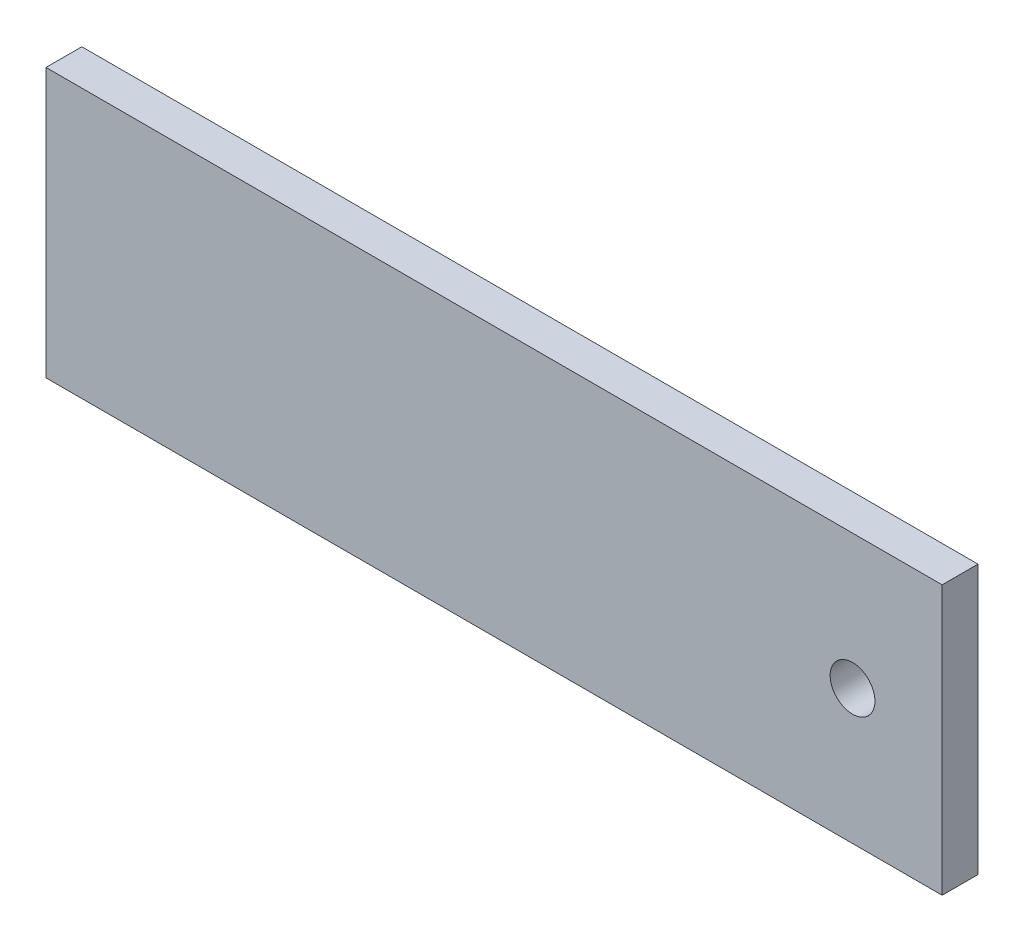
ISO-10303-21;
HEADER;
FILE_DESCRIPTION(('STEP AP214'),'2;1');
FILE_NAME('part.step','',(''),(''),'','','');
FILE_SCHEMA(('AUTOMOTIVE_DESIGN { 1 0 10303 214 1 1 1 1 }'));
ENDSEC;
DATA;
#1=APPLICATION_CONTEXT('core data for automotive mechanical design processes');
#2=APPLICATION_PROTOCOL_DEFINITION('international standard','automotive_design',2000,#1);
#3=PRODUCT_CONTEXT('',#1,'mechanical');
#4=PRODUCT('Part','Part','',(#3));
#5=PRODUCT_RELATED_PRODUCT_CATEGORY('part','',(#4));
#6=PRODUCT_DEFINITION_FORMATION('','',#4);
#7=PRODUCT_DEFINITION_CONTEXT('part definition',#1,'design');
#8=PRODUCT_DEFINITION('design','',#6,#7);
#9=PRODUCT_DEFINITION_SHAPE('','',#8);
#10=(LENGTH_UNIT() NAMED_UNIT(*) SI_UNIT(.MILLI.,.METRE.));
#11=(NAMED_UNIT(*) PLANE_ANGLE_UNIT() SI_UNIT($,.RADIAN.));
#12=(NAMED_UNIT(*) SI_UNIT($,.STERADIAN.) SOLID_ANGLE_UNIT());
#13=UNCERTAINTY_MEASURE_WITH_UNIT(LENGTH_MEASURE(1.E-05),#10,'distance_accuracy_value','');
#14=(GEOMETRIC_REPRESENTATION_CONTEXT(3) GLOBAL_UNCERTAINTY_ASSIGNED_CONTEXT((#13)) GLOBAL_UNIT_ASSIGNED_CONTEXT((#10,
#11,#12)) REPRESENTATION_CONTEXT('',''));
#15=CARTESIAN_POINT('',(0.,0.,0.));
#16=DIRECTION('',(0.,0.,1.));
#17=DIRECTION('',(1.,0.,0.));
#18=AXIS2_PLACEMENT_3D('',#15,#16,#17);
#19=CARTESIAN_POINT('',(100.,0.,2.));
#20=DIRECTION('',(-1.,0.,0.));
#21=DIRECTION('',(0.,0.,1.));
#22=AXIS2_PLACEMENT_3D('',#19,#20,#21);
#23=PLANE('',#22);
#24=DIRECTION('',(0.,1.,0.));
#25=VECTOR('',#24,1.);
#26=CARTESIAN_POINT('',(100.,0.,-2.));
#27=LINE('',#26,#25);
#28=CARTESIAN_POINT('',(100.,-30.,-2.));
#29=VERTEX_POINT('',#28);
#30=CARTESIAN_POINT('',(100.,0.,-2.));
#31=VERTEX_POINT('',#30);
#32=EDGE_CURVE('E81',#29,#31,#27,.T.);
#33=ORIENTED_EDGE('',*,*,#32,.T.);
#34=DIRECTION('',(0.,0.,-1.));
#35=VECTOR('',#34,1.);
#36=CARTESIAN_POINT('',(100.,0.,2.));
#37=LINE('',#36,#35);
#38=CARTESIAN_POINT('',(100.,0.,2.));
#39=VERTEX_POINT('',#38);
#40=EDGE_CURVE('E11',#39,#31,#37,.T.);
#41=ORIENTED_EDGE('',*,*,#40,.F.);
#42=DIRECTION('',(0.,1.,0.));
#43=VECTOR('',#42,1.);
#44=CARTESIAN_POINT('',(100.,0.,2.));
#45=LINE('',#44,#43);
#46=CARTESIAN_POINT('',(100.,-30.,2.));
#47=VERTEX_POINT('',#46);
#48=EDGE_CURVE('E110',#47,#39,#45,.T.);
#49=ORIENTED_EDGE('',*,*,#48,.F.);
#50=DIRECTION('',(0.,0.,-1.));
#51=VECTOR('',#50,1.);
#52=CARTESIAN_POINT('',(100.,-30.,2.));
#53=LINE('',#52,#51);
#54=EDGE_CURVE('E94',#47,#29,#53,.T.);
#55=ORIENTED_EDGE('',*,*,#54,.T.);
#56=EDGE_LOOP('',(#33,#41,#49,#55));
#57=FACE_BOUND('',#56,.T.);
#58=ADVANCED_FACE('F36',(#57),#23,.F.);
#59=CARTESIAN_POINT('',(0.,0.,2.));
#60=DIRECTION('',(0.,-1.,0.));
#61=DIRECTION('',(1.,0.,0.));
#62=AXIS2_PLACEMENT_3D('',#59,#60,#61);
#63=PLANE('',#62);
#64=DIRECTION('',(-1.,0.,0.));
#65=VECTOR('',#64,1.);
#66=CARTESIAN_POINT('',(0.,0.,-2.));
#67=LINE('',#66,#65);
#68=CARTESIAN_POINT('',(0.,0.,-2.));
#69=VERTEX_POINT('',#68);
#70=EDGE_CURVE('E77',#31,#69,#67,.T.);
#71=ORIENTED_EDGE('',*,*,#70,.T.);
#72=DIRECTION('',(0.,0.,-1.));
#73=VECTOR('',#72,1.);
#74=CARTESIAN_POINT('',(0.,0.,2.));
#75=LINE('',#74,#73);
#76=CARTESIAN_POINT('',(0.,0.,2.));
#77=VERTEX_POINT('',#76);
#78=EDGE_CURVE('E44',#77,#69,#75,.T.);
#79=ORIENTED_EDGE('',*,*,#78,.F.);
#80=DIRECTION('',(-1.,0.,0.));
#81=VECTOR('',#80,1.);
#82=CARTESIAN_POINT('',(0.,0.,2.));
#83=LINE('',#82,#81);
#84=EDGE_CURVE('E90',#39,#77,#83,.T.);
#85=ORIENTED_EDGE('',*,*,#84,.F.);
#86=ORIENTED_EDGE('',*,*,#40,.T.);
#87=EDGE_LOOP('',(#71,#79,#85,#86));
#88=FACE_BOUND('',#87,.T.);
#89=ADVANCED_FACE('F89',(#88),#63,.F.);
#90=CARTESIAN_POINT('',(0.,-30.,2.));
#91=DIRECTION('',(1.,0.,0.));
#92=DIRECTION('',(0.,0.,-1.));
#93=AXIS2_PLACEMENT_3D('',#90,#91,#92);
#94=PLANE('',#93);
#95=DIRECTION('',(0.,-1.,0.));
#96=VECTOR('',#95,1.);
#97=CARTESIAN_POINT('',(0.,-30.,-2.));
#98=LINE('',#97,#96);
#99=CARTESIAN_POINT('',(0.,-30.,-2.));
#100=VERTEX_POINT('',#99);
#101=EDGE_CURVE('E82',#69,#100,#98,.T.);
#102=ORIENTED_EDGE('',*,*,#101,.T.);
#103=DIRECTION('',(0.,0.,-1.));
#104=VECTOR('',#103,1.);
#105=CARTESIAN_POINT('',(0.,-30.,2.));
#106=LINE('',#105,#104);
#107=CARTESIAN_POINT('',(0.,-30.,2.));
#108=VERTEX_POINT('',#107);
#109=EDGE_CURVE('E120',#108,#100,#106,.T.);
#110=ORIENTED_EDGE('',*,*,#109,.F.);
#111=DIRECTION('',(0.,-1.,0.));
#112=VECTOR('',#111,1.);
#113=CARTESIAN_POINT('',(0.,-30.,2.));
#114=LINE('',#113,#112);
#115=EDGE_CURVE('E56',#77,#108,#114,.T.);
#116=ORIENTED_EDGE('',*,*,#115,.F.);
#117=ORIENTED_EDGE('',*,*,#78,.T.);
#118=EDGE_LOOP('',(#102,#110,#116,#117));
#119=FACE_BOUND('',#118,.T.);
#120=ADVANCED_FACE('F125',(#119),#94,.F.);
#121=CARTESIAN_POINT('',(100.,-30.,2.));
#122=DIRECTION('',(0.,1.,0.));
#123=DIRECTION('',(-1.,0.,0.));
#124=AXIS2_PLACEMENT_3D('',#121,#122,#123);
#125=PLANE('',#124);
#126=DIRECTION('',(1.,0.,0.));
#127=VECTOR('',#126,1.);
#128=CARTESIAN_POINT('',(100.,-30.,-2.));
#129=LINE('',#128,#127);
#130=EDGE_CURVE('E107',#100,#29,#129,.T.);
#131=ORIENTED_EDGE('',*,*,#130,.T.);
#132=ORIENTED_EDGE('',*,*,#54,.F.);
#133=DIRECTION('',(1.,0.,0.));
#134=VECTOR('',#133,1.);
#135=CARTESIAN_POINT('',(100.,-30.,2.));
#136=LINE('',#135,#134);
#137=EDGE_CURVE('E51',#108,#47,#136,.T.);
#138=ORIENTED_EDGE('',*,*,#137,.F.);
#139=ORIENTED_EDGE('',*,*,#109,.T.);
#140=EDGE_LOOP('',(#131,#132,#138,#139));
#141=FACE_BOUND('',#140,.T.);
#142=ADVANCED_FACE('F127',(#141),#125,.F.);
#143=CARTESIAN_POINT('',(100.,0.,2.));
#144=DIRECTION('',(0.,0.,1.));
#145=DIRECTION('',(1.,0.,0.));
#146=AXIS2_PLACEMENT_3D('',#143,#144,#145);
#147=PLANE('',#146);
#148=CARTESIAN_POINT('',(90.,-15.,2.));
#149=DIRECTION('',(0.,0.,1.));
#150=DIRECTION('',(1.,0.,0.));
#151=AXIS2_PLACEMENT_3D('',#148,#149,#150);
#152=CIRCLE('',#151,2.5);
#153=CARTESIAN_POINT('',(92.5,-15.,2.));
#154=VERTEX_POINT('',#153);
#155=EDGE_CURVE('E96',#154,#154,#152,.T.);
#156=ORIENTED_EDGE('',*,*,#155,.F.);
#157=EDGE_LOOP('',(#156));
#158=FACE_BOUND('',#157,.T.);
#159=ORIENTED_EDGE('',*,*,#48,.T.);
#160=ORIENTED_EDGE('',*,*,#84,.T.);
#161=ORIENTED_EDGE('',*,*,#115,.T.);
#162=ORIENTED_EDGE('',*,*,#137,.T.);
#163=EDGE_LOOP('',(#159,#160,#161,#162));
#164=FACE_BOUND('',#163,.T.);
#165=ADVANCED_FACE('F128',(#158,#164),#147,.T.);
#166=CARTESIAN_POINT('',(100.,0.,-2.));
#167=DIRECTION('',(0.,0.,1.));
#168=DIRECTION('',(1.,0.,0.));
#169=AXIS2_PLACEMENT_3D('',#166,#167,#168);
#170=PLANE('',#169);
#171=CARTESIAN_POINT('',(90.,-15.,-2.));
#172=DIRECTION('',(0.,0.,1.));
#173=DIRECTION('',(1.,0.,0.));
#174=AXIS2_PLACEMENT_3D('',#171,#172,#173);
#175=CIRCLE('',#174,2.5);
#176=CARTESIAN_POINT('',(92.5,-15.,-2.));
#177=VERTEX_POINT('',#176);
#178=EDGE_CURVE('E101',#177,#177,#175,.T.);
#179=ORIENTED_EDGE('',*,*,#178,.T.);
#180=EDGE_LOOP('',(#179));
#181=FACE_BOUND('',#180,.T.);
#182=ORIENTED_EDGE('',*,*,#32,.F.);
#183=ORIENTED_EDGE('',*,*,#130,.F.);
#184=ORIENTED_EDGE('',*,*,#101,.F.);
#185=ORIENTED_EDGE('',*,*,#70,.F.);
#186=EDGE_LOOP('',(#182,#183,#184,#185));
#187=FACE_BOUND('',#186,.T.);
#188=ADVANCED_FACE('F78',(#181,#187),#170,.F.);
#189=CARTESIAN_POINT('',(90.,-15.,2.));
#190=DIRECTION('',(0.,0.,1.));
#191=DIRECTION('',(1.,0.,0.));
#192=AXIS2_PLACEMENT_3D('',#189,#190,#191);
#193=CYLINDRICAL_SURFACE('',#192,2.5);
#194=ORIENTED_EDGE('',*,*,#178,.F.);
#195=EDGE_LOOP('',(#194));
#196=FACE_BOUND('',#195,.T.);
#197=ORIENTED_EDGE('',*,*,#155,.T.);
#198=EDGE_LOOP('',(#197));
#199=FACE_BOUND('',#198,.T.);
#200=ADVANCED_FACE('F136',(#196,#199),#193,.F.);
#201=CLOSED_SHELL('',(#58,#89,#120,#142,#165,#188,#200));
#202=MANIFOLD_SOLID_BREP('B2',#201);
#203=ADVANCED_BREP_SHAPE_REPRESENTATION('',(#18,#202),#14);
#204=SHAPE_DEFINITION_REPRESENTATION(#9,#203);
ENDSEC;
END-ISO-10303-21;
